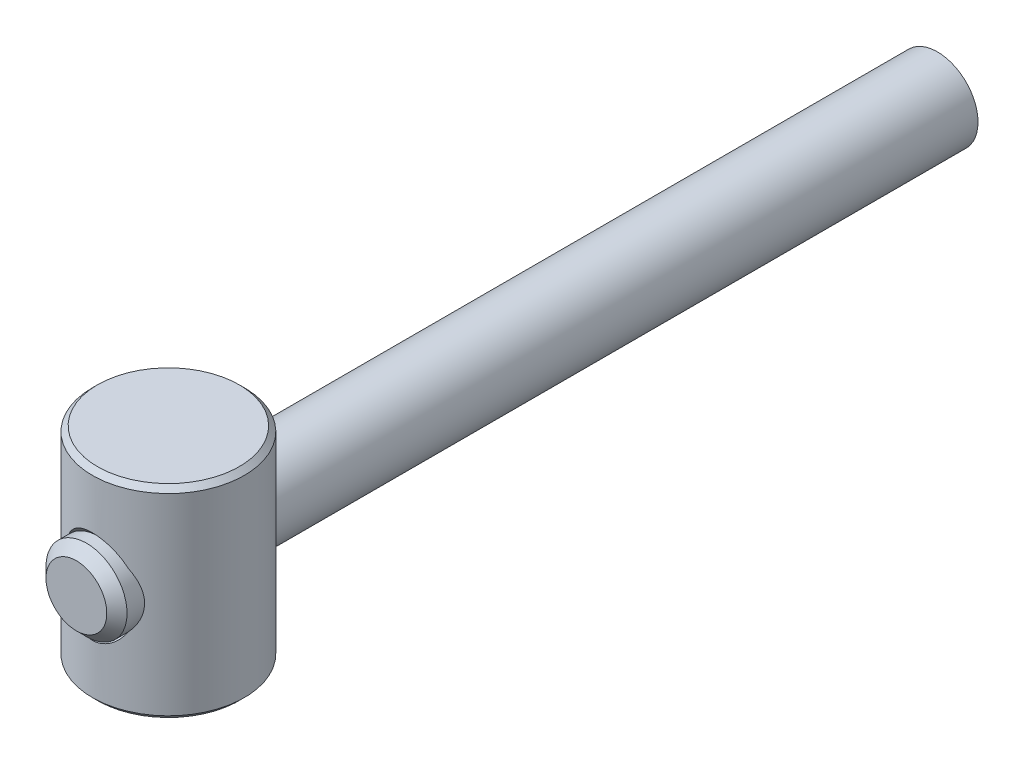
ISO-10303-21;
HEADER;
FILE_DESCRIPTION(('STEP AP214'),'2;1');
FILE_NAME('part.step','',(''),(''),'','','');
FILE_SCHEMA(('AUTOMOTIVE_DESIGN { 1 0 10303 214 1 1 1 1 }'));
ENDSEC;
DATA;
#1=APPLICATION_CONTEXT('core data for automotive mechanical design processes');
#2=APPLICATION_PROTOCOL_DEFINITION('international standard','automotive_design',2000,#1);
#3=PRODUCT_CONTEXT('',#1,'mechanical');
#4=PRODUCT('Part','Part','',(#3));
#5=PRODUCT_RELATED_PRODUCT_CATEGORY('part','',(#4));
#6=PRODUCT_DEFINITION_FORMATION('','',#4);
#7=PRODUCT_DEFINITION_CONTEXT('part definition',#1,'design');
#8=PRODUCT_DEFINITION('design','',#6,#7);
#9=PRODUCT_DEFINITION_SHAPE('','',#8);
#10=(LENGTH_UNIT() NAMED_UNIT(*) SI_UNIT(.MILLI.,.METRE.));
#11=(NAMED_UNIT(*) PLANE_ANGLE_UNIT() SI_UNIT($,.RADIAN.));
#12=(NAMED_UNIT(*) SI_UNIT($,.STERADIAN.) SOLID_ANGLE_UNIT());
#13=UNCERTAINTY_MEASURE_WITH_UNIT(LENGTH_MEASURE(1.E-05),#10,'distance_accuracy_value','');
#14=(GEOMETRIC_REPRESENTATION_CONTEXT(3) GLOBAL_UNCERTAINTY_ASSIGNED_CONTEXT((#13)) GLOBAL_UNIT_ASSIGNED_CONTEXT((#10,
#11,#12)) REPRESENTATION_CONTEXT('',''));
#15=CARTESIAN_POINT('',(0.,0.,0.));
#16=DIRECTION('',(0.,0.,1.));
#17=DIRECTION('',(1.,0.,0.));
#18=AXIS2_PLACEMENT_3D('',#15,#16,#17);
#19=CARTESIAN_POINT('',(0.,0.,-6.3));
#20=DIRECTION('',(0.,0.,-1.));
#21=DIRECTION('',(0.,-1.,0.));
#22=AXIS2_PLACEMENT_3D('',#19,#20,#21);
#23=CONICAL_SURFACE('',#22,3.4,0.785398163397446);
#24=CARTESIAN_POINT('',(0.,0.,-6.9));
#25=DIRECTION('',(0.,0.,-1.));
#26=DIRECTION('',(1.,0.,0.));
#27=AXIS2_PLACEMENT_3D('',#24,#25,#26);
#28=CIRCLE('',#27,4.);
#29=CARTESIAN_POINT('',(2.9393876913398,-2.71293199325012,-6.9));
#30=VERTEX_POINT('',#29);
#31=CARTESIAN_POINT('',(-2.93938769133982,-2.7129319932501,-6.9));
#32=VERTEX_POINT('',#31);
#33=EDGE_CURVE('E9',#30,#32,#28,.T.);
#34=ORIENTED_EDGE('',*,*,#33,.F.);
#35=CARTESIAN_POINT('',(2.74695573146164,-3.0151592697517,-6.97884189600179));
#36=CARTESIAN_POINT('',(2.90257075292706,-2.79053376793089,-6.91759441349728));
#37=CARTESIAN_POINT('',(3.03820810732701,-2.55144754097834,-6.85824252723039));
#38=CARTESIAN_POINT('',(3.2697402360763,-2.05214715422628,-6.7509377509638));
#39=CARTESIAN_POINT('',(3.36559478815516,-1.79191192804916,-6.70299641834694));
#40=CARTESIAN_POINT('',(3.47934964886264,-1.39021427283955,-6.64423773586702));
#41=CARTESIAN_POINT('',(3.5123403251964,-1.25380703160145,-6.62679707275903));
#42=CARTESIAN_POINT('',(3.56795242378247,-0.97836231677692,-6.59702440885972));
#43=CARTESIAN_POINT('',(3.5905776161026,-0.839325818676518,-6.58469055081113));
#44=CARTESIAN_POINT('',(3.6253556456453,-0.559663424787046,-6.56560629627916));
#45=CARTESIAN_POINT('',(3.63751494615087,-0.41903856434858,-6.55885245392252));
#46=CARTESIAN_POINT('',(3.65132517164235,-0.137113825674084,-6.55117461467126));
#47=CARTESIAN_POINT('',(3.65297625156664,0.00418604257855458,-6.55025053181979));
#48=CARTESIAN_POINT('',(3.64576471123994,0.286256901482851,-6.55426702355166));
#49=CARTESIAN_POINT('',(3.63691516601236,0.427028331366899,-6.55920030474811));
#50=CARTESIAN_POINT('',(3.60877216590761,0.707205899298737,-6.57472580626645));
#51=CARTESIAN_POINT('',(3.58947854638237,0.846612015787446,-6.58531811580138));
#52=CARTESIAN_POINT('',(3.54051597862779,1.12318872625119,-6.61177164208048));
#53=CARTESIAN_POINT('',(3.51083988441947,1.26035771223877,-6.6276364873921));
#54=CARTESIAN_POINT('',(3.44122114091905,1.53144593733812,-6.66404690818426));
#55=CARTESIAN_POINT('',(3.40127465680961,1.66536394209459,-6.68459423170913));
#56=CARTESIAN_POINT('',(3.26577486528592,2.06202938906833,-6.75241311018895));
#57=CARTESIAN_POINT('',(3.15474113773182,2.31866353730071,-6.80575527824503));
#58=CARTESIAN_POINT('',(2.89187923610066,2.80776269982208,-6.92153076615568));
#59=CARTESIAN_POINT('',(2.74007970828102,3.04024452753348,-6.98395768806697));
#60=CARTESIAN_POINT('',(2.43678521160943,3.42014107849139,-7.09446684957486));
#61=CARTESIAN_POINT('',(2.29400820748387,3.57456354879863,-7.14238580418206));
#62=CARTESIAN_POINT('',(1.98469030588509,3.85877036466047,-7.23442675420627));
#63=CARTESIAN_POINT('',(1.81819010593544,3.98859603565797,-7.27855504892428));
#64=CARTESIAN_POINT('',(1.49968128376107,4.19285145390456,-7.34995017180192));
#65=CARTESIAN_POINT('',(1.35183507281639,4.27318606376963,-7.37881574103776));
#66=CARTESIAN_POINT('',(1.04407205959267,4.4097402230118,-7.42860230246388));
#67=CARTESIAN_POINT('',(0.88416387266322,4.46597679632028,-7.44952890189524));
#68=CARTESIAN_POINT('',(0.554844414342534,4.55073271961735,-7.48128674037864));
#69=CARTESIAN_POINT('',(0.38537397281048,4.57905339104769,-7.49204559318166));
#70=CARTESIAN_POINT('',(0.0437720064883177,4.60478529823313,-7.50181427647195));
#71=CARTESIAN_POINT('',(-0.128358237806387,4.60221097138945,-7.50082959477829));
#72=CARTESIAN_POINT('',(-0.449560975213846,4.56849146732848,-7.48804485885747));
#73=CARTESIAN_POINT('',(-0.599042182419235,4.54060560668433,-7.47747873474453));
#74=CARTESIAN_POINT('',(-0.891233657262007,4.46267391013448,-7.44830693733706));
#75=CARTESIAN_POINT('',(-1.03394279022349,4.41262437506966,-7.42969992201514));
#76=CARTESIAN_POINT('',(-1.31639173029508,4.29031668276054,-7.38502161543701));
#77=CARTESIAN_POINT('',(-1.45567044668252,4.21711859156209,-7.35863842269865));
#78=CARTESIAN_POINT('',(-1.72210570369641,4.05288513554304,-7.30088881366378));
#79=CARTESIAN_POINT('',(-1.84925335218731,3.96183683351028,-7.26951878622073));
#80=CARTESIAN_POINT('',(-2.152674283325,3.71440338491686,-7.18692315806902));
#81=CARTESIAN_POINT('',(-2.32066560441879,3.54846915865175,-7.13377061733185));
#82=CARTESIAN_POINT('',(-2.62678313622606,3.19115083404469,-7.02683499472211));
#83=CARTESIAN_POINT('',(-2.76485389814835,2.99972052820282,-6.97305093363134));
#84=CARTESIAN_POINT('',(-3.01344203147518,2.5941225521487,-6.86932243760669));
#85=CARTESIAN_POINT('',(-3.12344530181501,2.37962076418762,-6.81945983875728));
#86=CARTESIAN_POINT('',(-3.31280831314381,1.93560864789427,-6.72951205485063));
#87=CARTESIAN_POINT('',(-3.39217808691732,1.7061032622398,-6.68942367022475));
#88=CARTESIAN_POINT('',(-3.49308524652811,1.33538849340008,-6.63702114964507));
#89=CARTESIAN_POINT('',(-3.524915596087,1.19752985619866,-6.62011062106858));
#90=CARTESIAN_POINT('',(-3.57804609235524,0.919218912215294,-6.59154844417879));
#91=CARTESIAN_POINT('',(-3.59934531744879,0.77876637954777,-6.57989725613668));
#92=CARTESIAN_POINT('',(-3.63130202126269,0.496309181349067,-6.56231485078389));
#93=CARTESIAN_POINT('',(-3.64195977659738,0.354304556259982,-6.55638348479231));
#94=CARTESIAN_POINT('',(-3.65257996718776,0.0697747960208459,-6.55047311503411));
#95=CARTESIAN_POINT('',(-3.65254281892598,-0.0727503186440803,-6.55049387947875));
#96=CARTESIAN_POINT('',(-3.64183112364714,-0.355750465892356,-6.55645499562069));
#97=CARTESIAN_POINT('',(-3.6312700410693,-0.496231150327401,-6.56233220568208));
#98=CARTESIAN_POINT('',(-3.59973628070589,-0.775667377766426,-6.57968238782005));
#99=CARTESIAN_POINT('',(-3.57876345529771,-0.914622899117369,-6.59115543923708));
#100=CARTESIAN_POINT('',(-3.5264815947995,-1.19012970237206,-6.61927577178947));
#101=CARTESIAN_POINT('',(-3.49516687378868,-1.32667961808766,-6.63592589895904));
#102=CARTESIAN_POINT('',(-3.42230946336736,-1.5963915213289,-6.67378939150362));
#103=CARTESIAN_POINT('',(-3.38076295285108,-1.72955222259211,-6.69500446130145));
#104=CARTESIAN_POINT('',(-3.24026206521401,-2.12441623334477,-6.76474834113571));
#105=CARTESIAN_POINT('',(-3.12577247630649,-2.37976586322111,-6.819184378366));
#106=CARTESIAN_POINT('',(-2.85586157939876,-2.86558090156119,-6.93654366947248));
#107=CARTESIAN_POINT('',(-2.70047298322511,-3.09606599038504,-6.9994601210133));
#108=CARTESIAN_POINT('',(-2.39280494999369,-3.46905408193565,-7.10942956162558));
#109=CARTESIAN_POINT('',(-2.2496422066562,-3.61907967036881,-7.156477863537));
#110=CARTESIAN_POINT('',(-1.94026831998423,-3.8945884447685,-7.2464610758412));
#111=CARTESIAN_POINT('',(-1.77409666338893,-4.02011280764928,-7.28940282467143));
#112=CARTESIAN_POINT('',(-1.45604681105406,-4.21743417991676,-7.35872077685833));
#113=CARTESIAN_POINT('',(-1.30808942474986,-4.29496375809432,-7.38669060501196));
#114=CARTESIAN_POINT('',(-1.00056912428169,-4.42589855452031,-7.43458112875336));
#115=CARTESIAN_POINT('',(-0.841014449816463,-4.47932070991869,-7.45450747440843));
#116=CARTESIAN_POINT('',(-0.513014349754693,-4.55857592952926,-7.48425440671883));
#117=CARTESIAN_POINT('',(-0.344516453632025,-4.58422147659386,-7.49400629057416));
#118=CARTESIAN_POINT('',(-0.00538565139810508,-4.60503767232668,-7.50191210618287));
#119=CARTESIAN_POINT('',(0.165246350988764,-4.60022081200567,-7.50007079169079));
#120=CARTESIAN_POINT('',(0.484218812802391,-4.56275214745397,-7.48587273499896));
#121=CARTESIAN_POINT('',(0.632984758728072,-4.53314623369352,-7.47466691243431));
#122=CARTESIAN_POINT('',(0.923540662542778,-4.45205257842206,-7.44435546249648));
#123=CARTESIAN_POINT('',(1.06532875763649,-4.4005590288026,-7.42524773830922));
#124=CARTESIAN_POINT('',(1.34682341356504,-4.27513674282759,-7.37953471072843));
#125=CARTESIAN_POINT('',(1.48598628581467,-4.2001295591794,-7.35257475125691));
#126=CARTESIAN_POINT('',(1.75193909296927,-4.0323616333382,-7.29378449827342));
#127=CARTESIAN_POINT('',(1.8787244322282,-3.93959433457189,-7.26195240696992));
#128=CARTESIAN_POINT('',(2.14226538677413,-3.7202219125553,-7.18907576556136));
#129=CARTESIAN_POINT('',(2.27628552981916,-3.59053862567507,-7.14743401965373));
#130=CARTESIAN_POINT('',(2.52562751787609,-3.31453971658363,-7.06318282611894));
#131=CARTESIAN_POINT('',(2.64092870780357,-3.16820602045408,-7.02057236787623));
#132=CARTESIAN_POINT('',(2.74695573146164,-3.0151592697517,-6.97884189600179));
#133=B_SPLINE_CURVE_WITH_KNOTS('',3,(#35,#36,#37,#38,#39,#40,#41,#42,#43,#44,#45,#46,#47,#48,
#49,#50,#51,#52,#53,#54,#55,#56,#57,#58,#59,#60,#61,#62,#63,#64,#65,#66,#67,#68,#69,#70,#71,#72,
#73,#74,#75,#76,#77,#78,#79,#80,#81,#82,#83,#84,#85,#86,#87,#88,#89,#90,#91,#92,#93,#94,#95,#96,
#97,#98,#99,#100,#101,#102,#103,#104,#105,#106,#107,#108,#109,#110,#111,#112,#113,#114,#115,
#116,#117,#118,#119,#120,#121,#122,#123,#124,#125,#126,#127,#128,#129,#130,#131,#132),
.UNSPECIFIED.,.T.,.F.,(4,2,2,2,2,2,2,2,2,2,2,2,2,2,2,2,2,2,2,2,2,2,2,2,2,2,2,2,2,2,2,2,2,2,2,2,
2,2,2,2,2,2,2,2,2,2,2,2,4),(0.,0.839450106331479,1.67974688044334,2.10359150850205,
2.52728185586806,2.95071036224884,3.3741326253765,3.79702821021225,4.21993046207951,
4.64312436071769,5.06647650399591,5.91627979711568,6.76548748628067,7.41033126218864,
8.05408182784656,8.56424779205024,9.07405275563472,9.58746037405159,10.1006280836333,
10.5558441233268,11.011136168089,11.4880010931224,11.9652129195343,12.6873639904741,
13.4108421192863,14.1467491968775,14.8824150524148,15.3094514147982,15.7365251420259,
16.1635877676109,16.5906337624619,17.0131248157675,17.435621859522,17.858351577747,
18.2812394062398,19.1322788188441,19.9826396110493,20.6183434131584,21.2529694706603,
21.7590698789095,22.2648141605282,22.7739517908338,23.2828806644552,23.7371354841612,
24.1915109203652,24.6708845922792,25.1504355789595,25.7217618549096,26.2937143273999),.UNSPECIFIED.);
#134=EDGE_CURVE('E19',#32,#30,#133,.T.);
#135=ORIENTED_EDGE('',*,*,#134,.F.);
#136=EDGE_LOOP('',(#34,#135));
#137=FACE_BOUND('',#136,.T.);
#138=ADVANCED_FACE('F14',(#137),#23,.F.);
#139=CARTESIAN_POINT('',(0.,0.,7.5));
#140=DIRECTION('',(0.,0.,1.));
#141=DIRECTION('',(0.,1.,0.));
#142=AXIS2_PLACEMENT_3D('',#139,#140,#141);
#143=CONICAL_SURFACE('',#142,4.6,0.785398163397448);
#144=CARTESIAN_POINT('',(0.,0.,6.9));
#145=DIRECTION('',(0.,0.,1.));
#146=DIRECTION('',(-1.,0.,0.));
#147=AXIS2_PLACEMENT_3D('',#144,#145,#146);
#148=CIRCLE('',#147,4.);
#149=CARTESIAN_POINT('',(-2.93938769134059,-2.71293199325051,6.9));
#150=VERTEX_POINT('',#149);
#151=CARTESIAN_POINT('',(2.93938769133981,-2.71293199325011,6.9));
#152=VERTEX_POINT('',#151);
#153=EDGE_CURVE('E76',#150,#152,#148,.T.);
#154=ORIENTED_EDGE('',*,*,#153,.F.);
#155=CARTESIAN_POINT('',(2.74695573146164,-3.01515926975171,6.9788418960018));
#156=CARTESIAN_POINT('',(2.63487182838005,-3.17695061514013,7.02295718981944));
#157=CARTESIAN_POINT('',(2.51241281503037,-3.33125721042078,7.06806045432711));
#158=CARTESIAN_POINT('',(2.24649506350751,-3.62105942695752,7.15701585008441));
#159=CARTESIAN_POINT('',(2.10305307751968,-3.75656988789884,7.20086894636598));
#160=CARTESIAN_POINT('',(1.81116222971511,-3.9911369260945,7.27943418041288));
#161=CARTESIAN_POINT('',(1.66470557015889,-4.09249913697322,7.31462238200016));
#162=CARTESIAN_POINT('',(1.35619234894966,-4.27132344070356,7.37803482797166));
#163=CARTESIAN_POINT('',(1.19414203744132,-4.34879505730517,7.40626184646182));
#164=CARTESIAN_POINT('',(0.941158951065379,-4.44352722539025,7.44121069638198));
#165=CARTESIAN_POINT('',(0.854690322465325,-4.4716169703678,7.45166408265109));
#166=CARTESIAN_POINT('',(0.679285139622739,-4.51982828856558,7.46969374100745));
#167=CARTESIAN_POINT('',(0.590349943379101,-4.53995415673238,7.4772715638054));
#168=CARTESIAN_POINT('',(0.41082473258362,-4.57175845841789,7.48927945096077));
#169=CARTESIAN_POINT('',(0.320235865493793,-4.58344253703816,7.49371161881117));
#170=CARTESIAN_POINT('',(0.138288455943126,-4.59810550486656,7.49927859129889));
#171=CARTESIAN_POINT('',(0.0469300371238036,-4.60108576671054,7.50041391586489));
#172=CARTESIAN_POINT('',(-0.200036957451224,-4.5972148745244,7.49893925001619));
#173=CARTESIAN_POINT('',(-0.355583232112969,-4.5819619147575,7.49312856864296));
#174=CARTESIAN_POINT('',(-0.661499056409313,-4.52690946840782,7.47234982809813));
#175=CARTESIAN_POINT('',(-0.811867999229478,-4.48710711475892,7.45738069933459));
#176=CARTESIAN_POINT('',(-1.10270734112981,-4.38599774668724,7.41993096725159));
#177=CARTESIAN_POINT('',(-1.24324841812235,-4.32486861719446,7.39751256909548));
#178=CARTESIAN_POINT('',(-1.51359919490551,-4.1841604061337,7.3469708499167));
#179=CARTESIAN_POINT('',(-1.64340252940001,-4.10457048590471,7.31884417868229));
#180=CARTESIAN_POINT('',(-1.94991511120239,-3.88852980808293,7.24452493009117));
#181=CARTESIAN_POINT('',(-2.11970287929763,-3.74300680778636,7.19608750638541));
#182=CARTESIAN_POINT('',(-2.43255347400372,-3.42639724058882,7.09646168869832));
#183=CARTESIAN_POINT('',(-2.57556718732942,-3.25526471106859,7.04526845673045));
#184=CARTESIAN_POINT('',(-2.83731660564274,-2.89009489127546,6.94403798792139));
#185=CARTESIAN_POINT('',(-2.95555361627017,-2.69569209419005,6.89403972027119));
#186=CARTESIAN_POINT('',(-3.16459651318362,-2.29123558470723,6.80062210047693));
#187=CARTESIAN_POINT('',(-3.25540666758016,-2.08118431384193,6.7572017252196));
#188=CARTESIAN_POINT('',(-3.37883764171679,-1.73535483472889,6.69597687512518));
#189=CARTESIAN_POINT('',(-3.42024412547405,-1.6032161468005,6.67484824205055));
#190=CARTESIAN_POINT('',(-3.4929728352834,-1.33557542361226,6.63707991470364));
#191=CARTESIAN_POINT('',(-3.52429766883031,-1.20007426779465,6.62043905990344));
#192=CARTESIAN_POINT('',(-3.5767717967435,-0.926561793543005,6.59223714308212));
#193=CARTESIAN_POINT('',(-3.59791845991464,-0.788549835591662,6.58067739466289));
#194=CARTESIAN_POINT('',(-3.62993382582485,-0.510991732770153,6.56307212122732));
#195=CARTESIAN_POINT('',(-3.6408028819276,-0.371445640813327,6.55702640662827));
#196=CARTESIAN_POINT('',(-3.6522904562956,-0.0897593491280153,6.55063507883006));
#197=CARTESIAN_POINT('',(-3.6527571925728,0.0523890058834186,6.55037386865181));
#198=CARTESIAN_POINT('',(-3.64305146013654,0.336209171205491,6.55577644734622));
#199=CARTESIAN_POINT('',(-3.63287869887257,0.477880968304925,6.56144039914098));
#200=CARTESIAN_POINT('',(-3.6019387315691,0.759776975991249,6.57847652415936));
#201=CARTESIAN_POINT('',(-3.58116754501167,0.900000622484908,6.58985084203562));
#202=CARTESIAN_POINT('',(-3.5291364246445,1.17791427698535,6.61785817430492));
#203=CARTESIAN_POINT('',(-3.49787657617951,1.3156043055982,6.63449114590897));
#204=CARTESIAN_POINT('',(-3.38917782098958,1.72100059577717,6.69105790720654));
#205=CARTESIAN_POINT('',(-3.29650817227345,1.98385953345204,6.7378504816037));
#206=CARTESIAN_POINT('',(-3.07092488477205,2.48903296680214,6.84359996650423));
#207=CARTESIAN_POINT('',(-2.93801395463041,2.73134884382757,6.90255605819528));
#208=CARTESIAN_POINT('',(-2.65884325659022,3.14735178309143,7.01419798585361));
#209=CARTESIAN_POINT('',(-2.51908983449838,3.32560039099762,7.06615154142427));
#210=CARTESIAN_POINT('',(-2.21189626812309,3.65699608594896,7.16823537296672));
#211=CARTESIAN_POINT('',(-2.04450322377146,3.81018500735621,7.21836857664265));
#212=CARTESIAN_POINT('',(-1.72452840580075,4.05205956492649,7.30045529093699));
#213=CARTESIAN_POINT('',(-1.57743060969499,4.14747381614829,7.33393528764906));
#214=CARTESIAN_POINT('',(-1.26858280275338,4.31426601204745,7.39359701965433));
#215=CARTESIAN_POINT('',(-1.10684267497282,4.38566001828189,7.41978362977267));
#216=CARTESIAN_POINT('',(-0.855246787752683,4.47137453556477,7.45156667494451));
#217=CARTESIAN_POINT('',(-0.769424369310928,4.49645530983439,7.46093973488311));
#218=CARTESIAN_POINT('',(-0.595623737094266,4.53876926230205,7.47681925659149));
#219=CARTESIAN_POINT('',(-0.507646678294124,4.55600655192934,7.48332722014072));
#220=CARTESIAN_POINT('',(-0.33033376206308,4.58222694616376,7.4932474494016));
#221=CARTESIAN_POINT('',(-0.240998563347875,4.59121393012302,7.49666117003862));
#222=CARTESIAN_POINT('',(-0.061845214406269,4.60074112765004,7.50028137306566));
#223=CARTESIAN_POINT('',(0.0279728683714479,4.60128249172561,7.50048829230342));
#224=CARTESIAN_POINT('',(0.271780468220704,4.59119498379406,7.49665184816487));
#225=CARTESIAN_POINT('',(0.425461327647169,4.57225200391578,7.48944447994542));
#226=CARTESIAN_POINT('',(0.727132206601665,4.51056102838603,7.46620756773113));
#227=CARTESIAN_POINT('',(0.875121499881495,4.46781000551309,7.45017690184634));
#228=CARTESIAN_POINT('',(1.16330674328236,4.36076765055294,7.41067138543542));
#229=CARTESIAN_POINT('',(1.30343132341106,4.29630765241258,7.38713832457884));
#230=CARTESIAN_POINT('',(1.57256392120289,4.14913513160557,7.33456848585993));
#231=CARTESIAN_POINT('',(1.70156489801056,4.0664111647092,7.30552825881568));
#232=CARTESIAN_POINT('',(2.00735064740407,3.8417084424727,7.22883649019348));
#233=CARTESIAN_POINT('',(2.17682019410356,3.6904896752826,7.17900754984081));
#234=CARTESIAN_POINT('',(2.48815132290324,3.36249901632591,7.0771504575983));
#235=CARTESIAN_POINT('',(2.62996178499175,3.18568084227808,7.02511844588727));
#236=CARTESIAN_POINT('',(2.8884216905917,2.80913348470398,6.92290826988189));
#237=CARTESIAN_POINT('',(3.00456315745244,2.6090442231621,6.87278146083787));
#238=CARTESIAN_POINT('',(3.20853201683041,2.1933566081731,6.77996362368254));
#239=CARTESIAN_POINT('',(3.29636505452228,1.9777613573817,6.73727111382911));
#240=CARTESIAN_POINT('',(3.41383155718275,1.62459604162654,6.67818322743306));
#241=CARTESIAN_POINT('',(3.45265324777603,1.49060651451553,6.65812460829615));
#242=CARTESIAN_POINT('',(3.5200601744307,1.21947615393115,6.6227363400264));
#243=CARTESIAN_POINT('',(3.54864816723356,1.08233617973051,6.6074054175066));
#244=CARTESIAN_POINT('',(3.5954929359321,0.805791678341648,6.5820315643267));
#245=CARTESIAN_POINT('',(3.61374737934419,0.66638664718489,6.57198982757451));
#246=CARTESIAN_POINT('',(3.63983148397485,0.386315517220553,6.55757961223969));
#247=CARTESIAN_POINT('',(3.64766155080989,0.245649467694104,6.5532109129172));
#248=CARTESIAN_POINT('',(3.65287110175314,-0.0367939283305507,6.55030857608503));
#249=CARTESIAN_POINT('',(3.6501867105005,-0.178572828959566,6.55181060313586));
#250=CARTESIAN_POINT('',(3.6342394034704,-0.461350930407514,6.56066956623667));
#251=CARTESIAN_POINT('',(3.62097617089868,-0.602350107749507,6.56802667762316));
#252=CARTESIAN_POINT('',(3.58393029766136,-0.882602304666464,6.58831486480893));
#253=CARTESIAN_POINT('',(3.56014453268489,-1.02185479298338,6.60124759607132));
#254=CARTESIAN_POINT('',(3.50215567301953,-1.29761404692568,6.63219170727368));
#255=CARTESIAN_POINT('',(3.46794893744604,-1.43411983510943,6.65020486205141));
#256=CARTESIAN_POINT('',(3.35287395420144,-1.82775382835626,6.70936715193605));
#257=CARTESIAN_POINT('',(3.25806080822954,-2.08006715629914,6.75653593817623));
#258=CARTESIAN_POINT('',(3.03077011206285,-2.56451257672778,6.8614890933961));
#259=CARTESIAN_POINT('',(2.89832413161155,-2.79666137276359,6.91926455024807));
#260=CARTESIAN_POINT('',(2.74695573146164,-3.01515926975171,6.9788418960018));
#261=B_SPLINE_CURVE_WITH_KNOTS('',3,(#155,#156,#157,#158,#159,#160,#161,#162,#163,#164,#165,
#166,#167,#168,#169,#170,#171,#172,#173,#174,#175,#176,#177,#178,#179,#180,#181,#182,#183,#184,
#185,#186,#187,#188,#189,#190,#191,#192,#193,#194,#195,#196,#197,#198,#199,#200,#201,#202,#203,
#204,#205,#206,#207,#208,#209,#210,#211,#212,#213,#214,#215,#216,#217,#218,#219,#220,#221,#222,
#223,#224,#225,#226,#227,#228,#229,#230,#231,#232,#233,#234,#235,#236,#237,#238,#239,#240,#241,
#242,#243,#244,#245,#246,#247,#248,#249,#250,#251,#252,#253,#254,#255,#256,#257,#258,#259,#260),
.UNSPECIFIED.,.T.,.F.,(4,2,2,2,2,2,2,2,2,2,2,2,2,2,2,2,2,2,2,2,2,2,2,2,2,2,2,2,2,2,2,2,2,2,2,2,
2,2,2,2,2,2,2,2,2,2,2,2,2,2,2,2,4),(0.,0.604606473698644,1.20873285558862,1.75143021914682,
2.29391096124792,2.56810111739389,2.84214319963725,3.11600185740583,3.3898173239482,
3.85646570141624,4.32316858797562,4.78606830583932,5.24924049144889,5.93190268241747,
6.61580510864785,7.31237371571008,8.00883386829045,8.42864917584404,8.84835581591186,
9.26817089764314,9.68797154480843,10.1138936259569,10.5398274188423,10.9659213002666,
11.392011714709,12.2357491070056,13.0794297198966,13.7740635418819,14.4675256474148,
15.0010964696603,15.5343097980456,15.803668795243,16.0728864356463,16.3419774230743,
16.6110317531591,17.0736001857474,17.5362274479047,18.0025353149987,18.4691362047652,
19.1629171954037,19.8579685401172,20.5657402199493,21.2733706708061,21.6957515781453,
22.1180186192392,22.5403809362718,22.9627268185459,23.3876424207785,23.812570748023,
24.2376253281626,24.6628285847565,25.4800282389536,26.2965443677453),.UNSPECIFIED.);
#262=EDGE_CURVE('E68',#152,#150,#261,.T.);
#263=ORIENTED_EDGE('',*,*,#262,.F.);
#264=EDGE_LOOP('',(#154,#263));
#265=FACE_BOUND('',#264,.T.);
#266=ADVANCED_FACE('F145',(#265),#143,.F.);
#267=CARTESIAN_POINT('',(0.,10.,0.));
#268=DIRECTION('',(0.,-1.,0.));
#269=DIRECTION('',(1.,0.,0.));
#270=AXIS2_PLACEMENT_3D('',#267,#268,#269);
#271=CYLINDRICAL_SURFACE('',#270,7.5);
#272=ORIENTED_EDGE('',*,*,#134,.T.);
#273=CARTESIAN_POINT('',(4.,0.,-6.3442887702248));
#274=CARTESIAN_POINT('',(4.00000036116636,-0.103140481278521,-6.3442883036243));
#275=CARTESIAN_POINT('',(3.99600566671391,-0.206276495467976,-6.34681238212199));
#276=CARTESIAN_POINT('',(3.98008789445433,-0.411729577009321,-6.35680645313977));
#277=CARTESIAN_POINT('',(3.96816183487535,-0.514046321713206,-6.36427830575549));
#278=CARTESIAN_POINT('',(3.93652969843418,-0.717153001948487,-6.38389222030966));
#279=CARTESIAN_POINT('',(3.91681341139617,-0.81794075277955,-6.39604041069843));
#280=CARTESIAN_POINT('',(3.86986831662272,-1.0171580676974,-6.42455191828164));
#281=CARTESIAN_POINT('',(3.84263618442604,-1.11558656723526,-6.44091710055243));
#282=CARTESIAN_POINT('',(3.75051454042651,-1.40514108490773,-6.49528574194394));
#283=CARTESIAN_POINT('',(3.67496986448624,-1.591974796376,-6.53871434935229));
#284=CARTESIAN_POINT('',(3.49812708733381,-1.95015452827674,-6.63499735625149));
#285=CARTESIAN_POINT('',(3.39682481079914,-2.12149803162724,-6.68785328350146));
#286=CARTESIAN_POINT('',(3.16012884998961,-2.4618095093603,-6.80312517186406));
#287=CARTESIAN_POINT('',(3.02241665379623,-2.62901929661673,-6.86597249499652));
#288=CARTESIAN_POINT('',(2.72148987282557,-2.93942193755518,-6.99070595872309));
#289=CARTESIAN_POINT('',(2.55826105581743,-3.08260129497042,-7.05259154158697));
#290=CARTESIAN_POINT('',(2.28965803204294,-3.28195827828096,-7.14264550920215));
#291=CARTESIAN_POINT('',(2.1921806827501,-3.34787410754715,-7.17323616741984));
#292=CARTESIAN_POINT('',(1.99119263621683,-3.47117184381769,-7.23160286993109));
#293=CARTESIAN_POINT('',(1.88768456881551,-3.52855743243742,-7.25938012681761));
#294=CARTESIAN_POINT('',(1.67526048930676,-3.63422292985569,-7.31132412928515));
#295=CARTESIAN_POINT('',(1.56634482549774,-3.68250342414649,-7.33549110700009));
#296=CARTESIAN_POINT('',(1.34392506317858,-3.76936407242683,-7.37947845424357));
#297=CARTESIAN_POINT('',(1.2304237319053,-3.80794997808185,-7.39930140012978));
#298=CARTESIAN_POINT('',(1.00879348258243,-3.87228408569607,-7.4326232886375));
#299=CARTESIAN_POINT('',(0.900944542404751,-3.89880351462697,-7.44649710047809));
#300=CARTESIAN_POINT('',(0.682985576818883,-3.94282676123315,-7.46964064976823));
#301=CARTESIAN_POINT('',(0.572876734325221,-3.96033517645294,-7.47891273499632));
#302=CARTESIAN_POINT('',(0.351320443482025,-3.98610173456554,-7.49258884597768));
#303=CARTESIAN_POINT('',(0.239873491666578,-3.99436320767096,-7.4969946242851));
#304=CARTESIAN_POINT('',(0.0165987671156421,-4.00152460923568,-7.50081261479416));
#305=CARTESIAN_POINT('',(-0.0952289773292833,-4.00042521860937,-7.50022519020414));
#306=CARTESIAN_POINT('',(-0.307221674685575,-3.98945312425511,-7.49437902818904));
#307=CARTESIAN_POINT('',(-0.407445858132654,-3.9804592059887,-7.4895882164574));
#308=CARTESIAN_POINT('',(-0.60668334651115,-3.95500183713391,-7.47609058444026));
#309=CARTESIAN_POINT('',(-0.705696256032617,-3.9385360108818,-7.46738251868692));
#310=CARTESIAN_POINT('',(-0.999812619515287,-3.87818595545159,-7.43566388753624));
#311=CARTESIAN_POINT('',(-1.1921926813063,-3.82333843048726,-7.40705283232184));
#312=CARTESIAN_POINT('',(-1.56677227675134,-3.6858639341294,-7.33703480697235));
#313=CARTESIAN_POINT('',(-1.74882205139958,-3.60291170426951,-7.29547849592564));
#314=CARTESIAN_POINT('',(-2.09683305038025,-3.41213903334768,-7.20317443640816));
#315=CARTESIAN_POINT('',(-2.26278884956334,-3.30431024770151,-7.15242360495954));
#316=CARTESIAN_POINT('',(-2.59223860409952,-3.05407972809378,-7.0401449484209));
#317=CARTESIAN_POINT('',(-2.75369756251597,-2.9092539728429,-6.97804534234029));
#318=CARTESIAN_POINT('',(-3.05119735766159,-2.59557982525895,-6.85319448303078));
#319=CARTESIAN_POINT('',(-3.18721401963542,-2.42670885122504,-6.79044266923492));
#320=CARTESIAN_POINT('',(-3.44073017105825,-2.05331687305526,-6.66580027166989));
#321=CARTESIAN_POINT('',(-3.55590786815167,-1.84703119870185,-6.60437206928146));
#322=CARTESIAN_POINT('',(-3.70076234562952,-1.52263810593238,-6.52360492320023));
#323=CARTESIAN_POINT('',(-3.74440046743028,-1.41199184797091,-6.49857494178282));
#324=CARTESIAN_POINT('',(-3.82186664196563,-1.18639266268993,-6.45332075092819));
#325=CARTESIAN_POINT('',(-3.85570113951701,-1.0714426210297,-6.43309338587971));
#326=CARTESIAN_POINT('',(-3.91073492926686,-0.847557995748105,-6.39977370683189));
#327=CARTESIAN_POINT('',(-3.93273271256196,-0.738885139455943,-6.38623776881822));
#328=CARTESIAN_POINT('',(-3.96765953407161,-0.519606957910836,-6.36459759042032));
#329=CARTESIAN_POINT('',(-3.98059363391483,-0.409002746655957,-6.3564903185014));
#330=CARTESIAN_POINT('',(-3.99718238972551,-0.186891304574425,-6.34607201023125));
#331=CARTESIAN_POINT('',(-4.00084242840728,-0.0753846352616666,-6.3437576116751));
#332=CARTESIAN_POINT('',(-3.99883249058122,0.147503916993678,-6.34502488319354));
#333=CARTESIAN_POINT('',(-3.99316337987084,0.258885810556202,-6.34860600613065));
#334=CARTESIAN_POINT('',(-3.97396833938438,0.465704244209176,-6.36063535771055));
#335=CARTESIAN_POINT('',(-3.96158788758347,0.561290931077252,-6.36837276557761));
#336=CARTESIAN_POINT('',(-3.93005725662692,0.750935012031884,-6.3878781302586));
#337=CARTESIAN_POINT('',(-3.91090488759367,0.844991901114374,-6.39964739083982));
#338=CARTESIAN_POINT('',(-3.84359837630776,1.1239552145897,-6.44046230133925));
#339=CARTESIAN_POINT('',(-3.78558312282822,1.30577685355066,-6.47502296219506));
#340=CARTESIAN_POINT('',(-3.64239055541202,1.66496121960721,-6.55667740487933));
#341=CARTESIAN_POINT('',(-3.55612415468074,1.84176990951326,-6.60425843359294));
#342=CARTESIAN_POINT('',(-3.35976377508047,2.17948538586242,-6.7062822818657));
#343=CARTESIAN_POINT('',(-3.24965767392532,2.3403840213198,-6.76072858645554));
#344=CARTESIAN_POINT('',(-2.98991165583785,2.66647114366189,-6.87995159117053));
#345=CARTESIAN_POINT('',(-2.83683827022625,2.82880566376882,-6.94506930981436));
#346=CARTESIAN_POINT('',(-2.50479844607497,3.1266050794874,-7.07159638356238));
#347=CARTESIAN_POINT('',(-2.3258192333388,3.26205664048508,-7.13300388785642));
#348=CARTESIAN_POINT('',(-2.03675011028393,3.44461965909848,-7.21889091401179));
#349=CARTESIAN_POINT('',(-1.93468262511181,3.50298595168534,-7.24697909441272));
#350=CARTESIAN_POINT('',(-1.72510702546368,3.61079923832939,-7.2997023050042));
#351=CARTESIAN_POINT('',(-1.61760136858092,3.66025021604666,-7.32433887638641));
#352=CARTESIAN_POINT('',(-1.39793131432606,3.7496460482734,-7.36942043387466));
#353=CARTESIAN_POINT('',(-1.28576954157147,3.78959617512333,-7.38986774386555));
#354=CARTESIAN_POINT('',(-1.05761863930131,3.85949081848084,-7.4259525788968));
#355=CARTESIAN_POINT('',(-0.9416300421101,3.88943672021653,-7.44159076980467));
#356=CARTESIAN_POINT('',(-0.71847938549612,3.93642915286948,-7.46626527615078));
#357=CARTESIAN_POINT('',(-0.611578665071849,3.95445841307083,-7.47580150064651));
#358=CARTESIAN_POINT('',(-0.39636340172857,3.98179087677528,-7.4902952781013));
#359=CARTESIAN_POINT('',(-0.288048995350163,3.99109491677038,-7.49525326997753));
#360=CARTESIAN_POINT('',(-0.0709496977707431,4.0008460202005,-7.50045011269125));
#361=CARTESIAN_POINT('',(0.0378350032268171,4.00129638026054,-7.50069072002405));
#362=CARTESIAN_POINT('',(0.254983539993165,3.99334290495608,-7.4964509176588));
#363=CARTESIAN_POINT('',(0.363347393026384,3.98493943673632,-7.49197070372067));
#364=CARTESIAN_POINT('',(0.569969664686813,3.96043642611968,-7.47896770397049));
#365=CARTESIAN_POINT('',(0.668332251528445,3.94501950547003,-7.47080392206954));
#366=CARTESIAN_POINT('',(0.863288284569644,3.90699542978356,-7.45079580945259));
#367=CARTESIAN_POINT('',(0.959881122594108,3.88438585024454,-7.43895023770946));
#368=CARTESIAN_POINT('',(1.24600292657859,3.80611193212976,-7.3982735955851));
#369=CARTESIAN_POINT('',(1.43205516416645,3.73998061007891,-7.36429057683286));
#370=CARTESIAN_POINT('',(1.79715929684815,3.57932500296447,-7.28399359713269));
#371=CARTESIAN_POINT('',(1.97568263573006,3.48382406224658,-7.23726296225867));
#372=CARTESIAN_POINT('',(2.31484960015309,3.26831138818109,-7.13602243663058));
#373=CARTESIAN_POINT('',(2.47548547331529,3.14828909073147,-7.08150919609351));
#374=CARTESIAN_POINT('',(2.7930353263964,2.87194190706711,-6.96281363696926));
#375=CARTESIAN_POINT('',(2.94758313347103,2.71307271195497,-6.89822811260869));
#376=CARTESIAN_POINT('',(3.22896696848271,2.37123931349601,-6.77108894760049));
#377=CARTESIAN_POINT('',(3.35577238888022,2.18824885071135,-6.70853761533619));
#378=CARTESIAN_POINT('',(3.52559711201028,1.89314871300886,-6.62001185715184));
#379=CARTESIAN_POINT('',(3.57990094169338,1.78838552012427,-6.59071626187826));
#380=CARTESIAN_POINT('',(3.6793246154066,1.57370376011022,-6.53573201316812));
#381=CARTESIAN_POINT('',(3.724449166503,1.46378787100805,-6.51004151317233));
#382=CARTESIAN_POINT('',(3.80487821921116,1.23977074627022,-6.46336317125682));
#383=CARTESIAN_POINT('',(3.84020707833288,1.12568070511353,-6.44236369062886));
#384=CARTESIAN_POINT('',(3.90064740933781,0.894015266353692,-6.40595027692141));
#385=CARTESIAN_POINT('',(3.92576564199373,0.776442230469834,-6.39053264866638));
#386=CARTESIAN_POINT('',(3.96360790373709,0.549415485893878,-6.36712346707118));
#387=CARTESIAN_POINT('',(3.97723402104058,0.440167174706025,-6.35859431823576));
#388=CARTESIAN_POINT('',(3.99543004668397,0.220610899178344,-6.34717711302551));
#389=CARTESIAN_POINT('',(3.99999961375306,0.110302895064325,-6.34428926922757));
#390=CARTESIAN_POINT('',(4.,0.,-6.3442887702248));
#391=B_SPLINE_CURVE_WITH_KNOTS('',3,(#273,#274,#275,#276,#277,#278,#279,#280,#281,#282,#283,
#284,#285,#286,#287,#288,#289,#290,#291,#292,#293,#294,#295,#296,#297,#298,#299,#300,#301,#302,
#303,#304,#305,#306,#307,#308,#309,#310,#311,#312,#313,#314,#315,#316,#317,#318,#319,#320,#321,
#322,#323,#324,#325,#326,#327,#328,#329,#330,#331,#332,#333,#334,#335,#336,#337,#338,#339,#340,
#341,#342,#343,#344,#345,#346,#347,#348,#349,#350,#351,#352,#353,#354,#355,#356,#357,#358,#359,
#360,#361,#362,#363,#364,#365,#366,#367,#368,#369,#370,#371,#372,#373,#374,#375,#376,#377,#378,
#379,#380,#381,#382,#383,#384,#385,#386,#387,#388,#389,#390),.UNSPECIFIED.,.T.,.F.,(4,2,2,2,2,2,
2,2,2,2,2,2,2,2,2,2,2,2,2,2,2,2,2,2,2,2,2,2,2,2,2,2,2,2,2,2,2,2,2,2,2,2,2,2,2,2,2,2,2,2,2,2,2,2,
2,2,2,2,4),(0.,0.309306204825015,0.618728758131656,0.928558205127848,1.23852491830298,
1.85411962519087,2.46981418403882,3.14375489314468,3.81807285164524,4.18241824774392,
4.54660593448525,4.91077019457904,5.27471788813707,5.61002887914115,5.94516861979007,
6.28018762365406,6.61518225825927,6.91703282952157,7.21897944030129,7.82228215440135,
8.432820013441,9.04356296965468,9.71755822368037,10.3921906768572,11.1202885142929,
11.4844677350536,11.8484070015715,12.183018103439,12.5174421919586,12.8516721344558,
13.1858710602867,13.475612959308,13.7654486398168,14.3447543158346,14.9497143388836,
15.5549827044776,16.2493340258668,16.9440289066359,17.3062683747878,17.6683455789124,
18.0302213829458,18.3920470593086,18.7180939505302,19.0441095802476,19.3700038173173,
19.6958845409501,19.9952213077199,20.294659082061,20.892996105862,21.5138963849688,
22.1350647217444,22.8247691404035,23.5152306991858,23.8795582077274,24.2436984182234,
24.6069248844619,24.9699104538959,25.3006834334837,25.6314688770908),.UNSPECIFIED.);
#392=CARTESIAN_POINT('',(2.93938769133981,2.71293199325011,-6.9));
#393=VERTEX_POINT('',#392);
#394=EDGE_CURVE('E25',#393,#30,#391,.T.);
#395=ORIENTED_EDGE('',*,*,#394,.F.);
#396=CARTESIAN_POINT('',(-2.93938769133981,2.71293199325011,-6.9));
#397=VERTEX_POINT('',#396);
#398=EDGE_CURVE('E69',#393,#397,#133,.T.);
#399=ORIENTED_EDGE('',*,*,#398,.T.);
#400=CARTESIAN_POINT('',(-0.619473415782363,-3.95174046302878,-7.4743730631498));
#401=CARTESIAN_POINT('',(-0.727542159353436,-3.9348158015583,-7.46543558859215));
#402=CARTESIAN_POINT('',(-0.834695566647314,-3.91346126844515,-7.45417629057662));
#403=CARTESIAN_POINT('',(-1.0463365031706,-3.86225210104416,-7.42741362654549));
#404=CARTESIAN_POINT('',(-1.15082577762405,-3.83240319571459,-7.41191312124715));
#405=CARTESIAN_POINT('',(-1.35592921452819,-3.76471333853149,-7.3771429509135));
#406=CARTESIAN_POINT('',(-1.45656034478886,-3.72691369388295,-7.35789280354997));
#407=CARTESIAN_POINT('',(-1.65386810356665,-3.64365174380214,-7.31607172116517));
#408=CARTESIAN_POINT('',(-1.75054414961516,-3.59818831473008,-7.29350029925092));
#409=CARTESIAN_POINT('',(-2.03333856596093,-3.45116394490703,-7.22171602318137));
#410=CARTESIAN_POINT('',(-2.21289288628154,-3.33874500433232,-7.16831414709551));
#411=CARTESIAN_POINT('',(-2.55097220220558,-3.08819748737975,-7.05510280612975));
#412=CARTESIAN_POINT('',(-2.70946423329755,-2.95002940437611,-6.9952835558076));
#413=CARTESIAN_POINT('',(-3.01452336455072,-2.63891047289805,-6.8696406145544));
#414=CARTESIAN_POINT('',(-3.15911722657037,-2.4640596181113,-6.8037198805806));
#415=CARTESIAN_POINT('',(-3.41759877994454,-2.09080662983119,-6.67763044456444));
#416=CARTESIAN_POINT('',(-3.53148042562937,-1.89239987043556,-6.6174628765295));
#417=CARTESIAN_POINT('',(-3.67718044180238,-1.5786009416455,-6.5369333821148));
#418=CARTESIAN_POINT('',(-3.72183077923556,-1.47030473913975,-6.51153628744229));
#419=CARTESIAN_POINT('',(-3.80168764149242,-1.24937733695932,-6.46523798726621));
#420=CARTESIAN_POINT('',(-3.83689931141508,-1.13674853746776,-6.44433433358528));
#421=CARTESIAN_POINT('',(-3.89733861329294,-0.908138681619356,-6.40796365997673));
#422=CARTESIAN_POINT('',(-3.92257894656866,-0.79216209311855,-6.39248972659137));
#423=CARTESIAN_POINT('',(-3.96270101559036,-0.557786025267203,-6.36769678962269));
#424=CARTESIAN_POINT('',(-3.97758485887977,-0.439387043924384,-6.35837653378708));
#425=CARTESIAN_POINT('',(-3.99538530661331,-0.21789383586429,-6.34720298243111));
#426=CARTESIAN_POINT('',(-3.99967359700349,-0.114950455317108,-6.34449446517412));
#427=CARTESIAN_POINT('',(-4.00029056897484,0.0910058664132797,-6.34410566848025));
#428=CARTESIAN_POINT('',(-3.99661674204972,0.194018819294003,-6.34642697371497));
#429=CARTESIAN_POINT('',(-3.98135916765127,0.399193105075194,-6.35600981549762));
#430=CARTESIAN_POINT('',(-3.96977794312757,0.50135469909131,-6.3632697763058));
#431=CARTESIAN_POINT('',(-3.93888457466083,0.704073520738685,-6.38243762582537));
#432=CARTESIAN_POINT('',(-3.91956935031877,0.804630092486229,-6.39434736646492));
#433=CARTESIAN_POINT('',(-3.85342479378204,1.08965777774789,-6.43457140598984));
#434=CARTESIAN_POINT('',(-3.79725869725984,1.27131179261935,-6.46815679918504));
#435=CARTESIAN_POINT('',(-3.66093829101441,1.62269887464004,-6.54626972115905));
#436=CARTESIAN_POINT('',(-3.58077719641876,1.79242855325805,-6.59080034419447));
#437=CARTESIAN_POINT('',(-3.38778202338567,2.13690523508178,-6.69224621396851));
#438=CARTESIAN_POINT('',(-3.27220368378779,2.30986814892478,-6.75000348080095));
#439=CARTESIAN_POINT('',(-3.01619573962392,2.63543596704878,-6.86822080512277));
#440=CARTESIAN_POINT('',(-2.87574173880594,2.78802062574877,-6.9286834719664));
#441=CARTESIAN_POINT('',(-2.55408877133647,3.08714350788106,-7.05406718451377));
#442=CARTESIAN_POINT('',(-2.37002355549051,3.2307626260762,-7.11865344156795));
#443=CARTESIAN_POINT('',(-1.97754232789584,3.48479181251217,-7.23748362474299));
#444=CARTESIAN_POINT('',(-1.76917082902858,3.59526130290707,-7.29174599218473));
#445=CARTESIAN_POINT('',(-1.40337897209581,3.74917098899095,-7.36908610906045));
#446=CARTESIAN_POINT('',(-1.25111341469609,3.80274283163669,-7.39658112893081));
#447=CARTESIAN_POINT('',(-1.01769117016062,3.86922096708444,-7.43105067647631));
#448=CARTESIAN_POINT('',(-0.938970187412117,3.88907917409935,-7.44141823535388));
#449=CARTESIAN_POINT('',(-0.780162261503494,3.92402415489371,-7.45974224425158));
#450=CARTESIAN_POINT('',(-0.700074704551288,3.9391087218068,-7.46769757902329));
#451=CARTESIAN_POINT('',(-0.619473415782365,3.95174046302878,-7.4743730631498));
#452=B_SPLINE_CURVE_WITH_KNOTS('',3,(#400,#401,#402,#403,#404,#405,#406,#407,#408,#409,#410,
#411,#412,#413,#414,#415,#416,#417,#418,#419,#420,#421,#422,#423,#424,#425,#426,#427,#428,#429,
#430,#431,#432,#433,#434,#435,#436,#437,#438,#439,#440,#441,#442,#443,#444,#445,#446,#447,#448,
#449,#450,#451),.UNSPECIFIED.,.F.,.F.,(4,2,2,2,2,2,2,2,2,2,2,2,2,2,2,2,2,2,2,2,2,2,2,2,2,4),(0.,
0.329091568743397,0.65796170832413,0.985163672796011,1.31241365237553,1.96479176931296,
2.61817918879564,3.3239233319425,4.02980629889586,4.38894909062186,4.74789571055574,
5.10638362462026,5.46479856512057,5.77358541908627,6.08246957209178,6.39125521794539,
6.70016397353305,7.27684106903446,7.85368138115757,8.49879949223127,9.14455382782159,
9.86774287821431,10.5896277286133,11.079445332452,11.3248151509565,11.5702982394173),.UNSPECIFIED.);
#453=EDGE_CURVE('E106',#32,#397,#452,.T.);
#454=ORIENTED_EDGE('',*,*,#453,.F.);
#455=EDGE_LOOP('',(#272,#395,#399,#454));
#456=FACE_BOUND('',#455,.T.);
#457=CARTESIAN_POINT('',(4.,0.,6.3442887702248));
#458=CARTESIAN_POINT('',(4.00000036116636,0.103140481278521,6.3442883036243));
#459=CARTESIAN_POINT('',(3.99600566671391,0.206276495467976,6.34681238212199));
#460=CARTESIAN_POINT('',(3.98008789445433,0.411729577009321,6.35680645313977));
#461=CARTESIAN_POINT('',(3.96816183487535,0.514046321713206,6.36427830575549));
#462=CARTESIAN_POINT('',(3.93652969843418,0.717153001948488,6.38389222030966));
#463=CARTESIAN_POINT('',(3.91681341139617,0.817940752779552,6.39604041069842));
#464=CARTESIAN_POINT('',(3.86986831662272,1.0171580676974,6.42455191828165));
#465=CARTESIAN_POINT('',(3.84263618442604,1.11558656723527,6.44091710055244));
#466=CARTESIAN_POINT('',(3.75051454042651,1.40514108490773,6.49528574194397));
#467=CARTESIAN_POINT('',(3.67496986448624,1.591974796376,6.53871434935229));
#468=CARTESIAN_POINT('',(3.49812708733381,1.95015452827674,6.63499735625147));
#469=CARTESIAN_POINT('',(3.39682481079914,2.12149803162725,6.68785328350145));
#470=CARTESIAN_POINT('',(3.16012884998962,2.46180950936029,6.80312517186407));
#471=CARTESIAN_POINT('',(3.02241665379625,2.62901929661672,6.86597249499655));
#472=CARTESIAN_POINT('',(2.72148987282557,2.93942193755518,6.99070595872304));
#473=CARTESIAN_POINT('',(2.55826105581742,3.08260129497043,7.05259154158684));
#474=CARTESIAN_POINT('',(2.28965803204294,3.28195827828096,7.14264550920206));
#475=CARTESIAN_POINT('',(2.19218068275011,3.34787410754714,7.17323616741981));
#476=CARTESIAN_POINT('',(1.99119263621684,3.47117184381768,7.2316028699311));
#477=CARTESIAN_POINT('',(1.88768456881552,3.52855743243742,7.25938012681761));
#478=CARTESIAN_POINT('',(1.67526048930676,3.63422292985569,7.31132412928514));
#479=CARTESIAN_POINT('',(1.56634482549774,3.68250342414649,7.33549110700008));
#480=CARTESIAN_POINT('',(1.34392506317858,3.76936407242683,7.37947845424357));
#481=CARTESIAN_POINT('',(1.2304237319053,3.80794997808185,7.39930140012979));
#482=CARTESIAN_POINT('',(1.00879348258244,3.87228408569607,7.4326232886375));
#483=CARTESIAN_POINT('',(0.900944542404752,3.89880351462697,7.44649710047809));
#484=CARTESIAN_POINT('',(0.682985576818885,3.94282676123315,7.46964064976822));
#485=CARTESIAN_POINT('',(0.572876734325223,3.96033517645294,7.47891273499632));
#486=CARTESIAN_POINT('',(0.351320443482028,3.98610173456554,7.49258884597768));
#487=CARTESIAN_POINT('',(0.23987349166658,3.99436320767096,7.4969946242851));
#488=CARTESIAN_POINT('',(0.0165987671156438,4.00152460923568,7.50081261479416));
#489=CARTESIAN_POINT('',(-0.095228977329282,4.00042521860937,7.50022519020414));
#490=CARTESIAN_POINT('',(-0.307221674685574,3.98945312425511,7.49437902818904));
#491=CARTESIAN_POINT('',(-0.407445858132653,3.9804592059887,7.4895882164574));
#492=CARTESIAN_POINT('',(-0.606683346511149,3.95500183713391,7.47609058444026));
#493=CARTESIAN_POINT('',(-0.705696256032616,3.9385360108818,7.46738251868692));
#494=CARTESIAN_POINT('',(-0.999812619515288,3.87818595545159,7.43566388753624));
#495=CARTESIAN_POINT('',(-1.1921926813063,3.82333843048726,7.40705283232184));
#496=CARTESIAN_POINT('',(-1.56677227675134,3.6858639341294,7.33703480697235));
#497=CARTESIAN_POINT('',(-1.74882205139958,3.60291170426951,7.29547849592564));
#498=CARTESIAN_POINT('',(-2.09683305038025,3.41213903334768,7.20317443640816));
#499=CARTESIAN_POINT('',(-2.26278884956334,3.30431024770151,7.15242360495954));
#500=CARTESIAN_POINT('',(-2.59223860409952,3.05407972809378,7.0401449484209));
#501=CARTESIAN_POINT('',(-2.75369756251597,2.9092539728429,6.97804534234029));
#502=CARTESIAN_POINT('',(-3.05119735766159,2.59557982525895,6.85319448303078));
#503=CARTESIAN_POINT('',(-3.18721401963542,2.42670885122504,6.79044266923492));
#504=CARTESIAN_POINT('',(-3.44073017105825,2.05331687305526,6.66580027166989));
#505=CARTESIAN_POINT('',(-3.55590786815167,1.84703119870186,6.60437206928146));
#506=CARTESIAN_POINT('',(-3.70076234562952,1.52263810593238,6.52360492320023));
#507=CARTESIAN_POINT('',(-3.74440046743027,1.41199184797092,6.49857494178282));
#508=CARTESIAN_POINT('',(-3.82186664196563,1.18639266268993,6.45332075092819));
#509=CARTESIAN_POINT('',(-3.85570113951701,1.0714426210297,6.43309338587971));
#510=CARTESIAN_POINT('',(-3.91073492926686,0.847557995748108,6.39977370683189));
#511=CARTESIAN_POINT('',(-3.93273271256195,0.738885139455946,6.38623776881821));
#512=CARTESIAN_POINT('',(-3.96765953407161,0.51960695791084,6.36459759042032));
#513=CARTESIAN_POINT('',(-3.98059363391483,0.409002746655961,6.3564903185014));
#514=CARTESIAN_POINT('',(-3.99718238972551,0.186891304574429,6.34607201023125));
#515=CARTESIAN_POINT('',(-4.00084242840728,0.0753846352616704,6.34375761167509));
#516=CARTESIAN_POINT('',(-3.99883249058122,-0.147503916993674,6.34502488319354));
#517=CARTESIAN_POINT('',(-3.99316337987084,-0.258885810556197,6.34860600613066));
#518=CARTESIAN_POINT('',(-3.97396833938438,-0.465704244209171,6.36063535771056));
#519=CARTESIAN_POINT('',(-3.96158788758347,-0.561290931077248,6.36837276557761));
#520=CARTESIAN_POINT('',(-3.93005725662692,-0.75093501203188,6.38787813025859));
#521=CARTESIAN_POINT('',(-3.91090488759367,-0.84499190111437,6.39964739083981));
#522=CARTESIAN_POINT('',(-3.84359837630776,-1.1239552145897,6.44046230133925));
#523=CARTESIAN_POINT('',(-3.78558312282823,-1.30577685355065,6.47502296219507));
#524=CARTESIAN_POINT('',(-3.64239055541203,-1.66496121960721,6.55667740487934));
#525=CARTESIAN_POINT('',(-3.55612415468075,-1.84176990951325,6.60425843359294));
#526=CARTESIAN_POINT('',(-3.35976377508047,-2.17948538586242,6.7062822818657));
#527=CARTESIAN_POINT('',(-3.24965767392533,-2.34038402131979,6.76072858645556));
#528=CARTESIAN_POINT('',(-2.98991165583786,-2.66647114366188,6.87995159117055));
#529=CARTESIAN_POINT('',(-2.83683827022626,-2.82880566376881,6.94506930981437));
#530=CARTESIAN_POINT('',(-2.50479844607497,-3.12660507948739,7.07159638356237));
#531=CARTESIAN_POINT('',(-2.32581923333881,-3.26205664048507,7.13300388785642));
#532=CARTESIAN_POINT('',(-2.03675011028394,-3.44461965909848,7.21889091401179));
#533=CARTESIAN_POINT('',(-1.93468262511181,-3.50298595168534,7.24697909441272));
#534=CARTESIAN_POINT('',(-1.72510702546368,-3.61079923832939,7.29970230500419));
#535=CARTESIAN_POINT('',(-1.61760136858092,-3.66025021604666,7.32433887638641));
#536=CARTESIAN_POINT('',(-1.39793131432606,-3.7496460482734,7.36942043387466));
#537=CARTESIAN_POINT('',(-1.28576954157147,-3.78959617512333,7.38986774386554));
#538=CARTESIAN_POINT('',(-1.05761863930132,-3.85949081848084,7.4259525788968));
#539=CARTESIAN_POINT('',(-0.941630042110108,-3.88943672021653,7.44159076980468));
#540=CARTESIAN_POINT('',(-0.718479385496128,-3.93642915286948,7.46626527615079));
#541=CARTESIAN_POINT('',(-0.611578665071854,-3.95445841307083,7.47580150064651));
#542=CARTESIAN_POINT('',(-0.396363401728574,-3.98179087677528,7.4902952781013));
#543=CARTESIAN_POINT('',(-0.288048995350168,-3.99109491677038,7.49525326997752));
#544=CARTESIAN_POINT('',(-0.0709496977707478,-4.0008460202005,7.50045011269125));
#545=CARTESIAN_POINT('',(0.0378350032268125,-4.00129638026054,7.50069072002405));
#546=CARTESIAN_POINT('',(0.25498353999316,-3.99334290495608,7.4964509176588));
#547=CARTESIAN_POINT('',(0.36334739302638,-3.98493943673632,7.49197070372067));
#548=CARTESIAN_POINT('',(0.569969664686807,-3.96043642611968,7.47896770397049));
#549=CARTESIAN_POINT('',(0.668332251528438,-3.94501950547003,7.47080392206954));
#550=CARTESIAN_POINT('',(0.863288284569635,-3.90699542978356,7.45079580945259));
#551=CARTESIAN_POINT('',(0.959881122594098,-3.88438585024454,7.43895023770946));
#552=CARTESIAN_POINT('',(1.24600292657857,-3.80611193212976,7.3982735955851));
#553=CARTESIAN_POINT('',(1.43205516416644,-3.73998061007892,7.36429057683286));
#554=CARTESIAN_POINT('',(1.79715929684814,-3.57932500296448,7.28399359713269));
#555=CARTESIAN_POINT('',(1.97568263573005,-3.48382406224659,7.23726296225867));
#556=CARTESIAN_POINT('',(2.31484960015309,-3.2683113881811,7.13602243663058));
#557=CARTESIAN_POINT('',(2.47548547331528,-3.14828909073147,7.08150919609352));
#558=CARTESIAN_POINT('',(2.7930353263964,-2.87194190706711,6.96281363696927));
#559=CARTESIAN_POINT('',(2.94758313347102,-2.71307271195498,6.8982281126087));
#560=CARTESIAN_POINT('',(3.2289669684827,-2.37123931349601,6.77108894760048));
#561=CARTESIAN_POINT('',(3.35577238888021,-2.18824885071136,6.70853761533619));
#562=CARTESIAN_POINT('',(3.52559711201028,-1.89314871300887,6.62001185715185));
#563=CARTESIAN_POINT('',(3.57990094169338,-1.78838552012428,6.59071626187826));
#564=CARTESIAN_POINT('',(3.6793246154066,-1.57370376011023,6.53573201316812));
#565=CARTESIAN_POINT('',(3.72444916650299,-1.46378787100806,6.51004151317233));
#566=CARTESIAN_POINT('',(3.80487821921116,-1.23977074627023,6.46336317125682));
#567=CARTESIAN_POINT('',(3.84020707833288,-1.12568070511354,6.44236369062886));
#568=CARTESIAN_POINT('',(3.90064740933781,-0.894015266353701,6.40595027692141));
#569=CARTESIAN_POINT('',(3.92576564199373,-0.776442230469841,6.3905326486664));
#570=CARTESIAN_POINT('',(3.96360790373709,-0.549415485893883,6.36712346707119));
#571=CARTESIAN_POINT('',(3.97723402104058,-0.44016717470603,6.35859431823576));
#572=CARTESIAN_POINT('',(3.99543004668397,-0.220610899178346,6.3471771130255));
#573=CARTESIAN_POINT('',(3.99999961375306,-0.110302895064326,6.34428926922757));
#574=CARTESIAN_POINT('',(4.,0.,6.3442887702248));
#575=B_SPLINE_CURVE_WITH_KNOTS('',3,(#457,#458,#459,#460,#461,#462,#463,#464,#465,#466,#467,
#468,#469,#470,#471,#472,#473,#474,#475,#476,#477,#478,#479,#480,#481,#482,#483,#484,#485,#486,
#487,#488,#489,#490,#491,#492,#493,#494,#495,#496,#497,#498,#499,#500,#501,#502,#503,#504,#505,
#506,#507,#508,#509,#510,#511,#512,#513,#514,#515,#516,#517,#518,#519,#520,#521,#522,#523,#524,
#525,#526,#527,#528,#529,#530,#531,#532,#533,#534,#535,#536,#537,#538,#539,#540,#541,#542,#543,
#544,#545,#546,#547,#548,#549,#550,#551,#552,#553,#554,#555,#556,#557,#558,#559,#560,#561,#562,
#563,#564,#565,#566,#567,#568,#569,#570,#571,#572,#573,#574),.UNSPECIFIED.,.T.,.F.,(4,2,2,2,2,2,
2,2,2,2,2,2,2,2,2,2,2,2,2,2,2,2,2,2,2,2,2,2,2,2,2,2,2,2,2,2,2,2,2,2,2,2,2,2,2,2,2,2,2,2,2,2,2,2,
2,2,2,2,4),(0.,0.309306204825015,0.618728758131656,0.92855820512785,1.23852491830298,
1.85411962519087,2.46981418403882,3.14375489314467,3.81807285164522,4.1824182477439,
4.54660593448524,4.91077019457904,5.27471788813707,5.61002887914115,5.94516861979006,
6.28018762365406,6.61518225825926,6.91703282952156,7.21897944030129,7.82228215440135,
8.432820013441,9.04356296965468,9.71755822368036,10.3921906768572,11.1202885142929,
11.4844677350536,11.8484070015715,12.183018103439,12.5174421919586,12.8516721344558,
13.1858710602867,13.475612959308,13.7654486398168,14.3447543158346,14.9497143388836,
15.5549827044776,16.2493340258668,16.9440289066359,17.3062683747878,17.6683455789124,
18.0302213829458,18.3920470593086,18.7180939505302,19.0441095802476,19.3700038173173,
19.6958845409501,19.9952213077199,20.294659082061,20.892996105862,21.5138963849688,
22.1350647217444,22.8247691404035,23.5152306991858,23.8795582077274,24.2436984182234,
24.6069248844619,24.9699104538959,25.3006834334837,25.6314688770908),.UNSPECIFIED.);
#576=CARTESIAN_POINT('',(2.93938769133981,2.71293199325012,6.9));
#577=VERTEX_POINT('',#576);
#578=EDGE_CURVE('E64',#152,#577,#575,.T.);
#579=ORIENTED_EDGE('',*,*,#578,.F.);
#580=ORIENTED_EDGE('',*,*,#262,.T.);
#581=CARTESIAN_POINT('',(-0.619473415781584,3.95174046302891,7.47437306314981));
#582=CARTESIAN_POINT('',(-0.727542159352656,3.93481580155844,7.46543558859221));
#583=CARTESIAN_POINT('',(-0.834695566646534,3.91346126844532,7.4541762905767));
#584=CARTESIAN_POINT('',(-1.04633650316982,3.86225210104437,7.42741362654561));
#585=CARTESIAN_POINT('',(-1.15082577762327,3.83240319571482,7.41191312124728));
#586=CARTESIAN_POINT('',(-1.35592921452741,3.76471333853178,7.37714295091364));
#587=CARTESIAN_POINT('',(-1.45656034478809,3.72691369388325,7.35789280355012));
#588=CARTESIAN_POINT('',(-1.65386810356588,3.64365174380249,7.31607172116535));
#589=CARTESIAN_POINT('',(-1.7505441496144,3.59818831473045,7.29350029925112));
#590=CARTESIAN_POINT('',(-2.03333856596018,3.45116394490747,7.22171602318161));
#591=CARTESIAN_POINT('',(-2.2128928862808,3.33874500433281,7.16831414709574));
#592=CARTESIAN_POINT('',(-2.55097220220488,3.08819748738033,7.05510280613));
#593=CARTESIAN_POINT('',(-2.70946423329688,2.95002940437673,6.9952835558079));
#594=CARTESIAN_POINT('',(-3.0145233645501,2.63891047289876,6.8696406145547));
#595=CARTESIAN_POINT('',(-3.15911722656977,2.46405961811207,6.80371988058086));
#596=CARTESIAN_POINT('',(-3.41759877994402,2.09080662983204,6.67763044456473));
#597=CARTESIAN_POINT('',(-3.5314804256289,1.89239987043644,6.61746287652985));
#598=CARTESIAN_POINT('',(-3.67718044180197,1.57860094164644,6.53693338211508));
#599=CARTESIAN_POINT('',(-3.72183077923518,1.4703047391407,6.51153628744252));
#600=CARTESIAN_POINT('',(-3.8016876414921,1.24937733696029,6.46523798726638));
#601=CARTESIAN_POINT('',(-3.83689931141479,1.13674853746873,6.44433433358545));
#602=CARTESIAN_POINT('',(-3.89733861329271,0.908138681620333,6.40796365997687));
#603=CARTESIAN_POINT('',(-3.92257894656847,0.792162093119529,6.39248972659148));
#604=CARTESIAN_POINT('',(-3.96270101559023,0.557786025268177,6.36769678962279));
#605=CARTESIAN_POINT('',(-3.97758485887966,0.439387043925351,6.35837653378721));
#606=CARTESIAN_POINT('',(-3.99538530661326,0.217893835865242,6.3472029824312));
#607=CARTESIAN_POINT('',(-3.99967359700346,0.114950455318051,6.34449446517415));
#608=CARTESIAN_POINT('',(-4.00029056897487,-0.0910058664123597,6.34410566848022));
#609=CARTESIAN_POINT('',(-3.99661674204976,-0.194018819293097,6.34642697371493));
#610=CARTESIAN_POINT('',(-3.98135916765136,-0.399193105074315,6.35600981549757));
#611=CARTESIAN_POINT('',(-3.96977794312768,-0.501354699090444,6.36326977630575));
#612=CARTESIAN_POINT('',(-3.93888457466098,-0.704073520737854,6.38243762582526));
#613=CARTESIAN_POINT('',(-3.91956935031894,-0.804630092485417,6.39434736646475));
#614=CARTESIAN_POINT('',(-3.85342479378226,-1.0896577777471,6.43457140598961));
#615=CARTESIAN_POINT('',(-3.79725869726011,-1.27131179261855,6.46815679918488));
#616=CARTESIAN_POINT('',(-3.66093829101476,-1.62269887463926,6.54626972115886));
#617=CARTESIAN_POINT('',(-3.58077719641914,-1.7924285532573,6.5908003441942));
#618=CARTESIAN_POINT('',(-3.38778202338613,-2.13690523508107,6.69224621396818));
#619=CARTESIAN_POINT('',(-3.27220368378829,-2.30986814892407,6.75000348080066));
#620=CARTESIAN_POINT('',(-3.01619573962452,-2.63543596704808,6.86822080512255));
#621=CARTESIAN_POINT('',(-2.8757417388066,-2.78802062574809,6.92868347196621));
#622=CARTESIAN_POINT('',(-2.55408877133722,-3.08714350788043,7.05406718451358));
#623=CARTESIAN_POINT('',(-2.3700235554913,-3.23076262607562,7.1186534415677));
#624=CARTESIAN_POINT('',(-1.9775423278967,-3.48479181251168,7.23748362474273));
#625=CARTESIAN_POINT('',(-1.7691708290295,-3.59526130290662,7.29174599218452));
#626=CARTESIAN_POINT('',(-1.4033789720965,-3.7491709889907,7.36908610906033));
#627=CARTESIAN_POINT('',(-1.25111341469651,-3.80274283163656,7.39658112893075));
#628=CARTESIAN_POINT('',(-1.01769117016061,-3.86922096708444,7.43105067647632));
#629=CARTESIAN_POINT('',(-0.938970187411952,-3.88907917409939,7.44141823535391));
#630=CARTESIAN_POINT('',(-0.780162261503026,-3.9240241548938,7.45974224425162));
#631=CARTESIAN_POINT('',(-0.700074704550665,-3.93910872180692,7.46769757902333));
#632=CARTESIAN_POINT('',(-0.619473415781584,-3.95174046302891,7.47437306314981));
#633=B_SPLINE_CURVE_WITH_KNOTS('',3,(#581,#582,#583,#584,#585,#586,#587,#588,#589,#590,#591,
#592,#593,#594,#595,#596,#597,#598,#599,#600,#601,#602,#603,#604,#605,#606,#607,#608,#609,#610,
#611,#612,#613,#614,#615,#616,#617,#618,#619,#620,#621,#622,#623,#624,#625,#626,#627,#628,#629,
#630,#631,#632),.UNSPECIFIED.,.F.,.F.,(4,2,2,2,2,2,2,2,2,2,2,2,2,2,2,2,2,2,2,2,2,2,2,2,2,4),(0.,
0.329091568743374,0.657961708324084,0.985163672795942,1.31241365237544,1.96479176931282,
2.61817918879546,3.32392333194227,4.02980629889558,4.3889490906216,4.7478957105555,
5.10638362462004,5.46479856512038,5.77358541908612,6.08246957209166,6.39125521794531,
6.70016397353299,7.27684106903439,7.85368138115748,8.49879949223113,9.1445538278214,
9.86774287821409,10.589627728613,11.0794453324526,11.3248151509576,11.5702982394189),.UNSPECIFIED.);
#634=CARTESIAN_POINT('',(-2.93938769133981,2.71293199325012,6.9));
#635=VERTEX_POINT('',#634);
#636=EDGE_CURVE('E66',#635,#150,#633,.T.);
#637=ORIENTED_EDGE('',*,*,#636,.F.);
#638=EDGE_CURVE('E60',#635,#577,#261,.T.);
#639=ORIENTED_EDGE('',*,*,#638,.T.);
#640=EDGE_LOOP('',(#579,#580,#637,#639));
#641=FACE_BOUND('',#640,.T.);
#642=CARTESIAN_POINT('',(0.,9.5,0.));
#643=DIRECTION('',(0.,1.,0.));
#644=DIRECTION('',(-1.,0.,0.));
#645=AXIS2_PLACEMENT_3D('',#642,#643,#644);
#646=CIRCLE('',#645,7.5);
#647=CARTESIAN_POINT('',(-7.5,9.5,0.));
#648=VERTEX_POINT('',#647);
#649=EDGE_CURVE('E115',#648,#648,#646,.F.);
#650=ORIENTED_EDGE('',*,*,#649,.T.);
#651=EDGE_LOOP('',(#650));
#652=FACE_BOUND('',#651,.T.);
#653=CARTESIAN_POINT('',(0.,-9.5,0.));
#654=DIRECTION('',(0.,1.,0.));
#655=DIRECTION('',(-1.,0.,0.));
#656=AXIS2_PLACEMENT_3D('',#653,#654,#655);
#657=CIRCLE('',#656,7.5);
#658=CARTESIAN_POINT('',(-7.5,-9.5,0.));
#659=VERTEX_POINT('',#658);
#660=EDGE_CURVE('E118',#659,#659,#657,.T.);
#661=ORIENTED_EDGE('',*,*,#660,.T.);
#662=EDGE_LOOP('',(#661));
#663=FACE_BOUND('',#662,.T.);
#664=ADVANCED_FACE('F16',(#456,#641,#652,#663),#271,.T.);
#665=EDGE_CURVE('E27',#397,#393,#28,.T.);
#666=ORIENTED_EDGE('',*,*,#665,.F.);
#667=ORIENTED_EDGE('',*,*,#398,.F.);
#668=EDGE_LOOP('',(#666,#667));
#669=FACE_BOUND('',#668,.T.);
#670=ADVANCED_FACE('F138',(#669),#23,.F.);
#671=EDGE_CURVE('E71',#577,#635,#148,.T.);
#672=ORIENTED_EDGE('',*,*,#671,.F.);
#673=ORIENTED_EDGE('',*,*,#638,.F.);
#674=EDGE_LOOP('',(#672,#673));
#675=FACE_BOUND('',#674,.T.);
#676=ADVANCED_FACE('F72',(#675),#143,.F.);
#677=CARTESIAN_POINT('',(0.,0.,9.08));
#678=DIRECTION('',(0.,0.,1.));
#679=DIRECTION('',(-1.,0.,0.));
#680=AXIS2_PLACEMENT_3D('',#677,#678,#679);
#681=PLANE('',#680);
#682=CARTESIAN_POINT('',(0.,0.,9.08));
#683=DIRECTION('',(0.,0.,1.));
#684=DIRECTION('',(-1.,0.,0.));
#685=AXIS2_PLACEMENT_3D('',#682,#683,#684);
#686=CIRCLE('',#685,3.);
#687=CARTESIAN_POINT('',(-3.,0.,9.08));
#688=VERTEX_POINT('',#687);
#689=EDGE_CURVE('E175',#688,#688,#686,.T.);
#690=ORIENTED_EDGE('',*,*,#689,.T.);
#691=EDGE_LOOP('',(#690));
#692=FACE_BOUND('',#691,.T.);
#693=ADVANCED_FACE('F98',(#692),#681,.T.);
#694=CARTESIAN_POINT('',(0.,0.,9.08));
#695=DIRECTION('',(0.,0.,-1.));
#696=DIRECTION('',(1.,0.,0.));
#697=AXIS2_PLACEMENT_3D('',#694,#695,#696);
#698=CONICAL_SURFACE('',#697,3.,0.785398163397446);
#699=CARTESIAN_POINT('',(0.,0.,8.08));
#700=DIRECTION('',(0.,0.,1.));
#701=DIRECTION('',(-1.,0.,0.));
#702=AXIS2_PLACEMENT_3D('',#699,#700,#701);
#703=CIRCLE('',#702,4.);
#704=CARTESIAN_POINT('',(-4.,0.,8.08));
#705=VERTEX_POINT('',#704);
#706=EDGE_CURVE('E74',#705,#705,#703,.F.);
#707=ORIENTED_EDGE('',*,*,#706,.F.);
#708=EDGE_LOOP('',(#707));
#709=FACE_BOUND('',#708,.T.);
#710=ORIENTED_EDGE('',*,*,#689,.F.);
#711=EDGE_LOOP('',(#710));
#712=FACE_BOUND('',#711,.T.);
#713=ADVANCED_FACE('F100',(#709,#712),#698,.T.);
#714=CARTESIAN_POINT('',(0.,0.,-15.92));
#715=DIRECTION('',(0.,0.,-1.));
#716=DIRECTION('',(1.,0.,0.));
#717=AXIS2_PLACEMENT_3D('',#714,#715,#716);
#718=CYLINDRICAL_SURFACE('',#717,4.);
#719=ORIENTED_EDGE('',*,*,#706,.T.);
#720=EDGE_LOOP('',(#719));
#721=FACE_BOUND('',#720,.T.);
#722=ORIENTED_EDGE('',*,*,#636,.T.);
#723=ORIENTED_EDGE('',*,*,#153,.T.);
#724=ORIENTED_EDGE('',*,*,#578,.T.);
#725=ORIENTED_EDGE('',*,*,#671,.T.);
#726=EDGE_LOOP('',(#722,#723,#724,#725));
#727=FACE_BOUND('',#726,.T.);
#728=ADVANCED_FACE('F78',(#721,#727),#718,.T.);
#729=CARTESIAN_POINT('',(0.,0.,-75.92));
#730=DIRECTION('',(0.,0.,-1.));
#731=DIRECTION('',(1.,0.,0.));
#732=AXIS2_PLACEMENT_3D('',#729,#730,#731);
#733=CIRCLE('',#732,4.);
#734=CARTESIAN_POINT('',(4.,0.,-75.92));
#735=VERTEX_POINT('',#734);
#736=EDGE_CURVE('E177',#735,#735,#733,.F.);
#737=ORIENTED_EDGE('',*,*,#736,.T.);
#738=EDGE_LOOP('',(#737));
#739=FACE_BOUND('',#738,.T.);
#740=ORIENTED_EDGE('',*,*,#394,.T.);
#741=ORIENTED_EDGE('',*,*,#33,.T.);
#742=ORIENTED_EDGE('',*,*,#453,.T.);
#743=ORIENTED_EDGE('',*,*,#665,.T.);
#744=EDGE_LOOP('',(#740,#741,#742,#743));
#745=FACE_BOUND('',#744,.T.);
#746=ADVANCED_FACE('F91',(#739,#745),#718,.T.);
#747=CARTESIAN_POINT('',(0.,0.,-75.92));
#748=DIRECTION('',(0.,0.,-1.));
#749=DIRECTION('',(1.,0.,0.));
#750=AXIS2_PLACEMENT_3D('',#747,#748,#749);
#751=PLANE('',#750);
#752=ORIENTED_EDGE('',*,*,#736,.F.);
#753=EDGE_LOOP('',(#752));
#754=FACE_BOUND('',#753,.T.);
#755=ADVANCED_FACE('F96',(#754),#751,.T.);
#756=CARTESIAN_POINT('',(0.,10.,0.));
#757=DIRECTION('',(0.,1.,0.));
#758=DIRECTION('',(-1.,0.,0.));
#759=AXIS2_PLACEMENT_3D('',#756,#757,#758);
#760=PLANE('',#759);
#761=CARTESIAN_POINT('',(0.,10.,0.));
#762=DIRECTION('',(0.,1.,0.));
#763=DIRECTION('',(-1.,0.,0.));
#764=AXIS2_PLACEMENT_3D('',#761,#762,#763);
#765=CIRCLE('',#764,7.);
#766=CARTESIAN_POINT('',(-7.,10.,0.));
#767=VERTEX_POINT('',#766);
#768=EDGE_CURVE('E124',#767,#767,#765,.T.);
#769=ORIENTED_EDGE('',*,*,#768,.T.);
#770=EDGE_LOOP('',(#769));
#771=FACE_BOUND('',#770,.T.);
#772=ADVANCED_FACE('F150',(#771),#760,.T.);
#773=CARTESIAN_POINT('',(0.,10.,0.));
#774=DIRECTION('',(0.,-1.,0.));
#775=DIRECTION('',(1.,0.,0.));
#776=AXIS2_PLACEMENT_3D('',#773,#774,#775);
#777=CONICAL_SURFACE('',#776,7.,0.785398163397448);
#778=ORIENTED_EDGE('',*,*,#649,.F.);
#779=EDGE_LOOP('',(#778));
#780=FACE_BOUND('',#779,.T.);
#781=ORIENTED_EDGE('',*,*,#768,.F.);
#782=EDGE_LOOP('',(#781));
#783=FACE_BOUND('',#782,.T.);
#784=ADVANCED_FACE('F146',(#780,#783),#777,.T.);
#785=CARTESIAN_POINT('',(0.,-10.,0.));
#786=DIRECTION('',(0.,1.,0.));
#787=DIRECTION('',(-1.,0.,0.));
#788=AXIS2_PLACEMENT_3D('',#785,#786,#787);
#789=PLANE('',#788);
#790=CARTESIAN_POINT('',(0.,-10.,0.));
#791=DIRECTION('',(0.,1.,0.));
#792=DIRECTION('',(-1.,0.,0.));
#793=AXIS2_PLACEMENT_3D('',#790,#791,#792);
#794=CIRCLE('',#793,7.);
#795=CARTESIAN_POINT('',(-7.,-10.,0.));
#796=VERTEX_POINT('',#795);
#797=EDGE_CURVE('E121',#796,#796,#794,.F.);
#798=ORIENTED_EDGE('',*,*,#797,.T.);
#799=EDGE_LOOP('',(#798));
#800=FACE_BOUND('',#799,.T.);
#801=ADVANCED_FACE('F149',(#800),#789,.F.);
#802=CARTESIAN_POINT('',(0.,-9.5,0.));
#803=DIRECTION('',(0.,1.,0.));
#804=DIRECTION('',(-1.,0.,0.));
#805=AXIS2_PLACEMENT_3D('',#802,#803,#804);
#806=CONICAL_SURFACE('',#805,7.5,0.785398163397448);
#807=ORIENTED_EDGE('',*,*,#797,.F.);
#808=EDGE_LOOP('',(#807));
#809=FACE_BOUND('',#808,.T.);
#810=ORIENTED_EDGE('',*,*,#660,.F.);
#811=EDGE_LOOP('',(#810));
#812=FACE_BOUND('',#811,.T.);
#813=ADVANCED_FACE('F152',(#809,#812),#806,.T.);
#814=CLOSED_SHELL('',(#138,#266,#664,#670,#676,#693,#713,#728,#746,#755,#772,#784,#801,#813));
#815=MANIFOLD_SOLID_BREP('B1',#814);
#816=ADVANCED_BREP_SHAPE_REPRESENTATION('',(#18,#815),#14);
#817=SHAPE_DEFINITION_REPRESENTATION(#9,#816);
ENDSEC;
END-ISO-10303-21;
